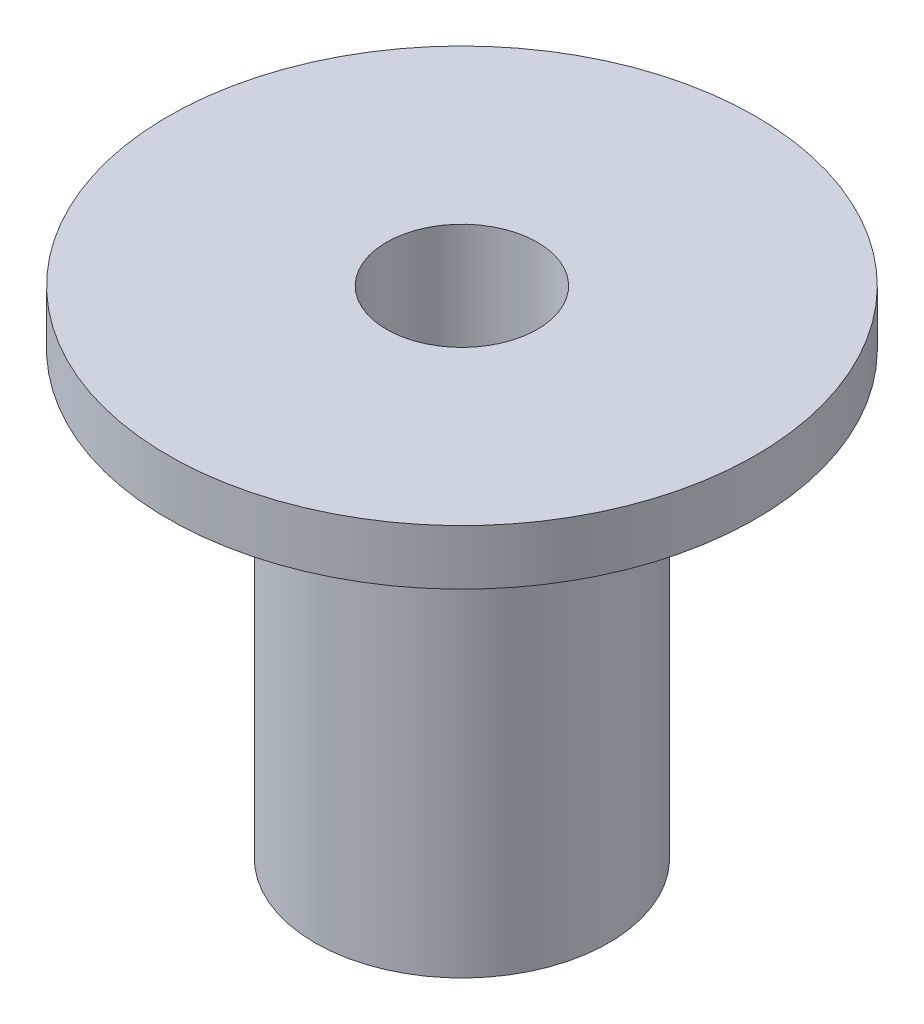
from build123d import *


with BuildPart() as part:
    # Sketch1 → Revolve1 (revolve)
    with BuildSketch(Plane.XY, mode=Mode.PRIVATE) as revolve1_sk:
        Polygon((3.2639, 0), (3.2639, 21.43125), (12.7, 21.43125), (12.7, 19.05), (6.35, 19.05), (6.35, 0), align=None)
    revolve(revolve1_sk.sketch.rotate(Axis((0, 0, 0), (0, 1, 0)), 90), axis=Axis((0, 0, 0), (0, 1, 0)))


solid = part.part
